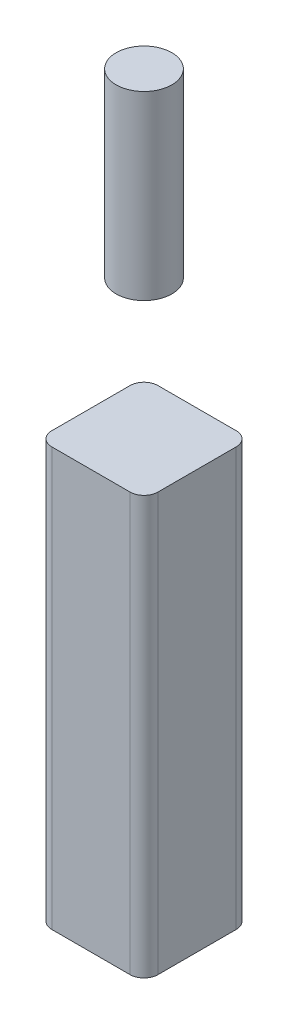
ISO-10303-21;
HEADER;
FILE_DESCRIPTION(('STEP AP214'),'2;1');
FILE_NAME('part.step','',(''),(''),'','','');
FILE_SCHEMA(('AUTOMOTIVE_DESIGN { 1 0 10303 214 1 1 1 1 }'));
ENDSEC;
DATA;
#1=APPLICATION_CONTEXT('core data for automotive mechanical design processes');
#2=APPLICATION_PROTOCOL_DEFINITION('international standard','automotive_design',2000,#1);
#3=PRODUCT_CONTEXT('',#1,'mechanical');
#4=PRODUCT('Part','Part','',(#3));
#5=PRODUCT_RELATED_PRODUCT_CATEGORY('part','',(#4));
#6=PRODUCT_DEFINITION_FORMATION('','',#4);
#7=PRODUCT_DEFINITION_CONTEXT('part definition',#1,'design');
#8=PRODUCT_DEFINITION('design','',#6,#7);
#9=PRODUCT_DEFINITION_SHAPE('','',#8);
#10=(LENGTH_UNIT() NAMED_UNIT(*) SI_UNIT(.MILLI.,.METRE.));
#11=(NAMED_UNIT(*) PLANE_ANGLE_UNIT() SI_UNIT($,.RADIAN.));
#12=(NAMED_UNIT(*) SI_UNIT($,.STERADIAN.) SOLID_ANGLE_UNIT());
#13=UNCERTAINTY_MEASURE_WITH_UNIT(LENGTH_MEASURE(1.E-05),#10,'distance_accuracy_value','');
#14=(GEOMETRIC_REPRESENTATION_CONTEXT(3) GLOBAL_UNCERTAINTY_ASSIGNED_CONTEXT((#13)) GLOBAL_UNIT_ASSIGNED_CONTEXT((#10,
#11,#12)) REPRESENTATION_CONTEXT('',''));
#15=CARTESIAN_POINT('',(0.,0.,0.));
#16=DIRECTION('',(0.,0.,1.));
#17=DIRECTION('',(1.,0.,0.));
#18=AXIS2_PLACEMENT_3D('',#15,#16,#17);
#19=CARTESIAN_POINT('',(0.,200.,0.));
#20=DIRECTION('',(0.,1.,0.));
#21=DIRECTION('',(0.,0.,1.));
#22=AXIS2_PLACEMENT_3D('',#19,#20,#21);
#23=CYLINDRICAL_SURFACE('',#22,10.);
#24=CARTESIAN_POINT('',(0.,200.,0.));
#25=DIRECTION('',(0.,1.,0.));
#26=DIRECTION('',(0.,0.,1.));
#27=AXIS2_PLACEMENT_3D('',#24,#25,#26);
#28=CIRCLE('',#27,10.);
#29=CARTESIAN_POINT('',(0.,200.,10.));
#30=VERTEX_POINT('',#29);
#31=EDGE_CURVE('E11',#30,#30,#28,.T.);
#32=ORIENTED_EDGE('',*,*,#31,.T.);
#33=EDGE_LOOP('',(#32));
#34=FACE_BOUND('',#33,.T.);
#35=CARTESIAN_POINT('',(0.,265.,0.));
#36=DIRECTION('',(0.,1.,0.));
#37=DIRECTION('',(0.,0.,1.));
#38=AXIS2_PLACEMENT_3D('',#35,#36,#37);
#39=CIRCLE('',#38,10.);
#40=CARTESIAN_POINT('',(0.,265.,10.));
#41=VERTEX_POINT('',#40);
#42=EDGE_CURVE('E43',#41,#41,#39,.T.);
#43=ORIENTED_EDGE('',*,*,#42,.F.);
#44=EDGE_LOOP('',(#43));
#45=FACE_BOUND('',#44,.T.);
#46=ADVANCED_FACE('F40',(#34,#45),#23,.T.);
#47=CARTESIAN_POINT('',(0.,200.,0.));
#48=DIRECTION('',(0.,1.,0.));
#49=DIRECTION('',(0.,0.,1.));
#50=AXIS2_PLACEMENT_3D('',#47,#48,#49);
#51=PLANE('',#50);
#52=ORIENTED_EDGE('',*,*,#31,.F.);
#53=EDGE_LOOP('',(#52));
#54=FACE_BOUND('',#53,.T.);
#55=ADVANCED_FACE('F55',(#54),#51,.F.);
#56=CARTESIAN_POINT('',(0.,265.,0.));
#57=DIRECTION('',(0.,1.,0.));
#58=DIRECTION('',(0.,0.,1.));
#59=AXIS2_PLACEMENT_3D('',#56,#57,#58);
#60=PLANE('',#59);
#61=ORIENTED_EDGE('',*,*,#42,.T.);
#62=EDGE_LOOP('',(#61));
#63=FACE_BOUND('',#62,.T.);
#64=ADVANCED_FACE('F52',(#63),#60,.T.);
#65=CLOSED_SHELL('',(#46,#55,#64));
#66=MANIFOLD_SOLID_BREP('B2',#65);
#67=CARTESIAN_POINT('',(19.05,150.,19.05));
#68=DIRECTION('',(-1.,0.,0.));
#69=DIRECTION('',(0.,0.,1.));
#70=AXIS2_PLACEMENT_3D('',#67,#68,#69);
#71=PLANE('',#70);
#72=DIRECTION('',(0.,0.,-1.));
#73=VECTOR('',#72,1.);
#74=CARTESIAN_POINT('',(19.05,150.,19.05));
#75=LINE('',#74,#73);
#76=CARTESIAN_POINT('',(19.05,150.,14.05));
#77=VERTEX_POINT('',#76);
#78=CARTESIAN_POINT('',(19.05,150.,-14.05));
#79=VERTEX_POINT('',#78);
#80=EDGE_CURVE('E165',#77,#79,#75,.T.);
#81=ORIENTED_EDGE('',*,*,#80,.F.);
#82=DIRECTION('',(0.,-1.,0.));
#83=VECTOR('',#82,1.);
#84=CARTESIAN_POINT('',(19.05,150.,14.05));
#85=LINE('',#84,#83);
#86=CARTESIAN_POINT('',(19.05,0.,14.05));
#87=VERTEX_POINT('',#86);
#88=EDGE_CURVE('E150',#77,#87,#85,.T.);
#89=ORIENTED_EDGE('',*,*,#88,.T.);
#90=DIRECTION('',(0.,0.,-1.));
#91=VECTOR('',#90,1.);
#92=CARTESIAN_POINT('',(19.05,0.,19.05));
#93=LINE('',#92,#91);
#94=CARTESIAN_POINT('',(19.05,0.,-14.05));
#95=VERTEX_POINT('',#94);
#96=EDGE_CURVE('E162',#87,#95,#93,.T.);
#97=ORIENTED_EDGE('',*,*,#96,.T.);
#98=DIRECTION('',(0.,-1.,0.));
#99=VECTOR('',#98,1.);
#100=CARTESIAN_POINT('',(19.05,150.,-14.05));
#101=LINE('',#100,#99);
#102=EDGE_CURVE('E167',#95,#79,#101,.F.);
#103=ORIENTED_EDGE('',*,*,#102,.T.);
#104=EDGE_LOOP('',(#81,#89,#97,#103));
#105=FACE_BOUND('',#104,.T.);
#106=ADVANCED_FACE('F80',(#105),#71,.F.);
#107=CARTESIAN_POINT('',(-19.05,150.,-19.05));
#108=DIRECTION('',(0.,0.,1.));
#109=DIRECTION('',(1.,0.,0.));
#110=AXIS2_PLACEMENT_3D('',#107,#108,#109);
#111=PLANE('',#110);
#112=DIRECTION('',(-1.,0.,0.));
#113=VECTOR('',#112,1.);
#114=CARTESIAN_POINT('',(-19.05,0.,-19.05));
#115=LINE('',#114,#113);
#116=CARTESIAN_POINT('',(14.05,0.,-19.05));
#117=VERTEX_POINT('',#116);
#118=CARTESIAN_POINT('',(-14.05,0.,-19.05));
#119=VERTEX_POINT('',#118);
#120=EDGE_CURVE('E172',#117,#119,#115,.T.);
#121=ORIENTED_EDGE('',*,*,#120,.T.);
#122=DIRECTION('',(0.,-1.,0.));
#123=VECTOR('',#122,1.);
#124=CARTESIAN_POINT('',(-14.05,150.,-19.05));
#125=LINE('',#124,#123);
#126=CARTESIAN_POINT('',(-14.05,150.,-19.05));
#127=VERTEX_POINT('',#126);
#128=EDGE_CURVE('E38',#119,#127,#125,.F.);
#129=ORIENTED_EDGE('',*,*,#128,.T.);
#130=DIRECTION('',(-1.,0.,0.));
#131=VECTOR('',#130,1.);
#132=CARTESIAN_POINT('',(-19.05,150.,-19.05));
#133=LINE('',#132,#131);
#134=CARTESIAN_POINT('',(14.05,150.,-19.05));
#135=VERTEX_POINT('',#134);
#136=EDGE_CURVE('E207',#135,#127,#133,.T.);
#137=ORIENTED_EDGE('',*,*,#136,.F.);
#138=DIRECTION('',(0.,-1.,0.));
#139=VECTOR('',#138,1.);
#140=CARTESIAN_POINT('',(14.05,150.,-19.05));
#141=LINE('',#140,#139);
#142=EDGE_CURVE('E88',#135,#117,#141,.T.);
#143=ORIENTED_EDGE('',*,*,#142,.T.);
#144=EDGE_LOOP('',(#121,#129,#137,#143));
#145=FACE_BOUND('',#144,.T.);
#146=ADVANCED_FACE('F205',(#145),#111,.F.);
#147=CARTESIAN_POINT('',(-19.05,150.,19.05));
#148=DIRECTION('',(1.,0.,0.));
#149=DIRECTION('',(0.,0.,-1.));
#150=AXIS2_PLACEMENT_3D('',#147,#148,#149);
#151=PLANE('',#150);
#152=DIRECTION('',(0.,0.,1.));
#153=VECTOR('',#152,1.);
#154=CARTESIAN_POINT('',(-19.05,150.,19.05));
#155=LINE('',#154,#153);
#156=CARTESIAN_POINT('',(-19.05,150.,-14.05));
#157=VERTEX_POINT('',#156);
#158=CARTESIAN_POINT('',(-19.05,150.,14.05));
#159=VERTEX_POINT('',#158);
#160=EDGE_CURVE('E215',#157,#159,#155,.T.);
#161=ORIENTED_EDGE('',*,*,#160,.F.);
#162=DIRECTION('',(0.,-1.,0.));
#163=VECTOR('',#162,1.);
#164=CARTESIAN_POINT('',(-19.05,150.,-14.05));
#165=LINE('',#164,#163);
#166=CARTESIAN_POINT('',(-19.05,0.,-14.05));
#167=VERTEX_POINT('',#166);
#168=EDGE_CURVE('E199',#157,#167,#165,.T.);
#169=ORIENTED_EDGE('',*,*,#168,.T.);
#170=DIRECTION('',(0.,0.,1.));
#171=VECTOR('',#170,1.);
#172=CARTESIAN_POINT('',(-19.05,0.,19.05));
#173=LINE('',#172,#171);
#174=CARTESIAN_POINT('',(-19.05,0.,14.05));
#175=VERTEX_POINT('',#174);
#176=EDGE_CURVE('E175',#167,#175,#173,.T.);
#177=ORIENTED_EDGE('',*,*,#176,.T.);
#178=DIRECTION('',(0.,-1.,0.));
#179=VECTOR('',#178,1.);
#180=CARTESIAN_POINT('',(-19.05,150.,14.05));
#181=LINE('',#180,#179);
#182=EDGE_CURVE('E95',#175,#159,#181,.F.);
#183=ORIENTED_EDGE('',*,*,#182,.T.);
#184=EDGE_LOOP('',(#161,#169,#177,#183));
#185=FACE_BOUND('',#184,.T.);
#186=ADVANCED_FACE('F214',(#185),#151,.F.);
#187=CARTESIAN_POINT('',(-19.05,150.,19.05));
#188=DIRECTION('',(0.,0.,-1.));
#189=DIRECTION('',(-1.,0.,0.));
#190=AXIS2_PLACEMENT_3D('',#187,#188,#189);
#191=PLANE('',#190);
#192=DIRECTION('',(1.,0.,0.));
#193=VECTOR('',#192,1.);
#194=CARTESIAN_POINT('',(-19.05,0.,19.05));
#195=LINE('',#194,#193);
#196=CARTESIAN_POINT('',(-14.05,0.,19.05));
#197=VERTEX_POINT('',#196);
#198=CARTESIAN_POINT('',(14.05,0.,19.05));
#199=VERTEX_POINT('',#198);
#200=EDGE_CURVE('E182',#197,#199,#195,.T.);
#201=ORIENTED_EDGE('',*,*,#200,.T.);
#202=DIRECTION('',(0.,-1.,0.));
#203=VECTOR('',#202,1.);
#204=CARTESIAN_POINT('',(14.05,150.,19.05));
#205=LINE('',#204,#203);
#206=CARTESIAN_POINT('',(14.05,150.,19.05));
#207=VERTEX_POINT('',#206);
#208=EDGE_CURVE('E151',#199,#207,#205,.F.);
#209=ORIENTED_EDGE('',*,*,#208,.T.);
#210=DIRECTION('',(1.,0.,0.));
#211=VECTOR('',#210,1.);
#212=CARTESIAN_POINT('',(-19.05,150.,19.05));
#213=LINE('',#212,#211);
#214=CARTESIAN_POINT('',(-14.05,150.,19.05));
#215=VERTEX_POINT('',#214);
#216=EDGE_CURVE('E178',#215,#207,#213,.T.);
#217=ORIENTED_EDGE('',*,*,#216,.F.);
#218=DIRECTION('',(0.,-1.,0.));
#219=VECTOR('',#218,1.);
#220=CARTESIAN_POINT('',(-14.05,150.,19.05));
#221=LINE('',#220,#219);
#222=EDGE_CURVE('E156',#215,#197,#221,.T.);
#223=ORIENTED_EDGE('',*,*,#222,.T.);
#224=EDGE_LOOP('',(#201,#209,#217,#223));
#225=FACE_BOUND('',#224,.T.);
#226=ADVANCED_FACE('F245',(#225),#191,.F.);
#227=CARTESIAN_POINT('',(0.,150.,0.));
#228=DIRECTION('',(0.,-1.,0.));
#229=DIRECTION('',(0.,0.,-1.));
#230=AXIS2_PLACEMENT_3D('',#227,#228,#229);
#231=PLANE('',#230);
#232=ORIENTED_EDGE('',*,*,#216,.T.);
#233=CARTESIAN_POINT('',(14.05,150.,14.05));
#234=DIRECTION('',(0.,-1.,0.));
#235=DIRECTION('',(0.,0.,-1.));
#236=AXIS2_PLACEMENT_3D('',#233,#234,#235);
#237=CIRCLE('',#236,5.);
#238=EDGE_CURVE('E196',#207,#77,#237,.F.);
#239=ORIENTED_EDGE('',*,*,#238,.T.);
#240=ORIENTED_EDGE('',*,*,#80,.T.);
#241=CARTESIAN_POINT('',(14.05,150.,-14.05));
#242=DIRECTION('',(0.,-1.,0.));
#243=DIRECTION('',(0.,0.,-1.));
#244=AXIS2_PLACEMENT_3D('',#241,#242,#243);
#245=CIRCLE('',#244,5.);
#246=EDGE_CURVE('E193',#79,#135,#245,.F.);
#247=ORIENTED_EDGE('',*,*,#246,.T.);
#248=ORIENTED_EDGE('',*,*,#136,.T.);
#249=CARTESIAN_POINT('',(-14.05,150.,-14.05));
#250=DIRECTION('',(0.,-1.,0.));
#251=DIRECTION('',(0.,0.,-1.));
#252=AXIS2_PLACEMENT_3D('',#249,#250,#251);
#253=CIRCLE('',#252,5.);
#254=EDGE_CURVE('E102',#127,#157,#253,.F.);
#255=ORIENTED_EDGE('',*,*,#254,.T.);
#256=ORIENTED_EDGE('',*,*,#160,.T.);
#257=CARTESIAN_POINT('',(-14.05,150.,14.05));
#258=DIRECTION('',(0.,-1.,0.));
#259=DIRECTION('',(0.,0.,-1.));
#260=AXIS2_PLACEMENT_3D('',#257,#258,#259);
#261=CIRCLE('',#260,5.);
#262=EDGE_CURVE('E191',#159,#215,#261,.F.);
#263=ORIENTED_EDGE('',*,*,#262,.T.);
#264=EDGE_LOOP('',(#232,#239,#240,#247,#248,#255,#256,#263));
#265=FACE_BOUND('',#264,.T.);
#266=ADVANCED_FACE('F220',(#265),#231,.F.);
#267=CARTESIAN_POINT('',(0.,0.,0.));
#268=DIRECTION('',(0.,-1.,0.));
#269=DIRECTION('',(0.,0.,-1.));
#270=AXIS2_PLACEMENT_3D('',#267,#268,#269);
#271=PLANE('',#270);
#272=ORIENTED_EDGE('',*,*,#96,.F.);
#273=CARTESIAN_POINT('',(14.05,0.,14.05));
#274=DIRECTION('',(0.,-1.,0.));
#275=DIRECTION('',(0.,0.,-1.));
#276=AXIS2_PLACEMENT_3D('',#273,#274,#275);
#277=CIRCLE('',#276,5.);
#278=EDGE_CURVE('E146',#87,#199,#277,.T.);
#279=ORIENTED_EDGE('',*,*,#278,.T.);
#280=ORIENTED_EDGE('',*,*,#200,.F.);
#281=CARTESIAN_POINT('',(-14.05,0.,14.05));
#282=DIRECTION('',(0.,-1.,0.));
#283=DIRECTION('',(0.,0.,-1.));
#284=AXIS2_PLACEMENT_3D('',#281,#282,#283);
#285=CIRCLE('',#284,5.);
#286=EDGE_CURVE('E166',#197,#175,#285,.T.);
#287=ORIENTED_EDGE('',*,*,#286,.T.);
#288=ORIENTED_EDGE('',*,*,#176,.F.);
#289=CARTESIAN_POINT('',(-14.05,0.,-14.05));
#290=DIRECTION('',(0.,-1.,0.));
#291=DIRECTION('',(0.,0.,-1.));
#292=AXIS2_PLACEMENT_3D('',#289,#290,#291);
#293=CIRCLE('',#292,5.);
#294=EDGE_CURVE('E157',#167,#119,#293,.T.);
#295=ORIENTED_EDGE('',*,*,#294,.T.);
#296=ORIENTED_EDGE('',*,*,#120,.F.);
#297=CARTESIAN_POINT('',(14.05,0.,-14.05));
#298=DIRECTION('',(0.,-1.,0.));
#299=DIRECTION('',(0.,0.,-1.));
#300=AXIS2_PLACEMENT_3D('',#297,#298,#299);
#301=CIRCLE('',#300,5.);
#302=EDGE_CURVE('E171',#117,#95,#301,.T.);
#303=ORIENTED_EDGE('',*,*,#302,.T.);
#304=EDGE_LOOP('',(#272,#279,#280,#287,#288,#295,#296,#303));
#305=FACE_BOUND('',#304,.T.);
#306=ADVANCED_FACE('F169',(#305),#271,.T.);
#307=CARTESIAN_POINT('',(14.05,150.,14.05));
#308=DIRECTION('',(0.,-1.,0.));
#309=DIRECTION('',(0.,0.,-1.));
#310=AXIS2_PLACEMENT_3D('',#307,#308,#309);
#311=CYLINDRICAL_SURFACE('',#310,5.);
#312=ORIENTED_EDGE('',*,*,#238,.F.);
#313=ORIENTED_EDGE('',*,*,#208,.F.);
#314=ORIENTED_EDGE('',*,*,#278,.F.);
#315=ORIENTED_EDGE('',*,*,#88,.F.);
#316=EDGE_LOOP('',(#312,#313,#314,#315));
#317=FACE_BOUND('',#316,.T.);
#318=ADVANCED_FACE('F149',(#317),#311,.T.);
#319=CARTESIAN_POINT('',(-14.05,150.,-14.05));
#320=DIRECTION('',(0.,-1.,0.));
#321=DIRECTION('',(0.,0.,-1.));
#322=AXIS2_PLACEMENT_3D('',#319,#320,#321);
#323=CYLINDRICAL_SURFACE('',#322,5.);
#324=ORIENTED_EDGE('',*,*,#254,.F.);
#325=ORIENTED_EDGE('',*,*,#128,.F.);
#326=ORIENTED_EDGE('',*,*,#294,.F.);
#327=ORIENTED_EDGE('',*,*,#168,.F.);
#328=EDGE_LOOP('',(#324,#325,#326,#327));
#329=FACE_BOUND('',#328,.T.);
#330=ADVANCED_FACE('F213',(#329),#323,.T.);
#331=CARTESIAN_POINT('',(14.05,150.,-14.05));
#332=DIRECTION('',(0.,-1.,0.));
#333=DIRECTION('',(0.,0.,-1.));
#334=AXIS2_PLACEMENT_3D('',#331,#332,#333);
#335=CYLINDRICAL_SURFACE('',#334,5.);
#336=ORIENTED_EDGE('',*,*,#246,.F.);
#337=ORIENTED_EDGE('',*,*,#102,.F.);
#338=ORIENTED_EDGE('',*,*,#302,.F.);
#339=ORIENTED_EDGE('',*,*,#142,.F.);
#340=EDGE_LOOP('',(#336,#337,#338,#339));
#341=FACE_BOUND('',#340,.T.);
#342=ADVANCED_FACE('F221',(#341),#335,.T.);
#343=CARTESIAN_POINT('',(-14.05,150.,14.05));
#344=DIRECTION('',(0.,-1.,0.));
#345=DIRECTION('',(0.,0.,-1.));
#346=AXIS2_PLACEMENT_3D('',#343,#344,#345);
#347=CYLINDRICAL_SURFACE('',#346,5.);
#348=ORIENTED_EDGE('',*,*,#262,.F.);
#349=ORIENTED_EDGE('',*,*,#182,.F.);
#350=ORIENTED_EDGE('',*,*,#286,.F.);
#351=ORIENTED_EDGE('',*,*,#222,.F.);
#352=EDGE_LOOP('',(#348,#349,#350,#351));
#353=FACE_BOUND('',#352,.T.);
#354=ADVANCED_FACE('F82',(#353),#347,.T.);
#355=CLOSED_SHELL('',(#106,#146,#186,#226,#266,#306,#318,#330,#342,#354));
#356=MANIFOLD_SOLID_BREP('B6',#355);
#357=ADVANCED_BREP_SHAPE_REPRESENTATION('',(#18,#66,#356),#14);
#358=SHAPE_DEFINITION_REPRESENTATION(#9,#357);
ENDSEC;
END-ISO-10303-21;
